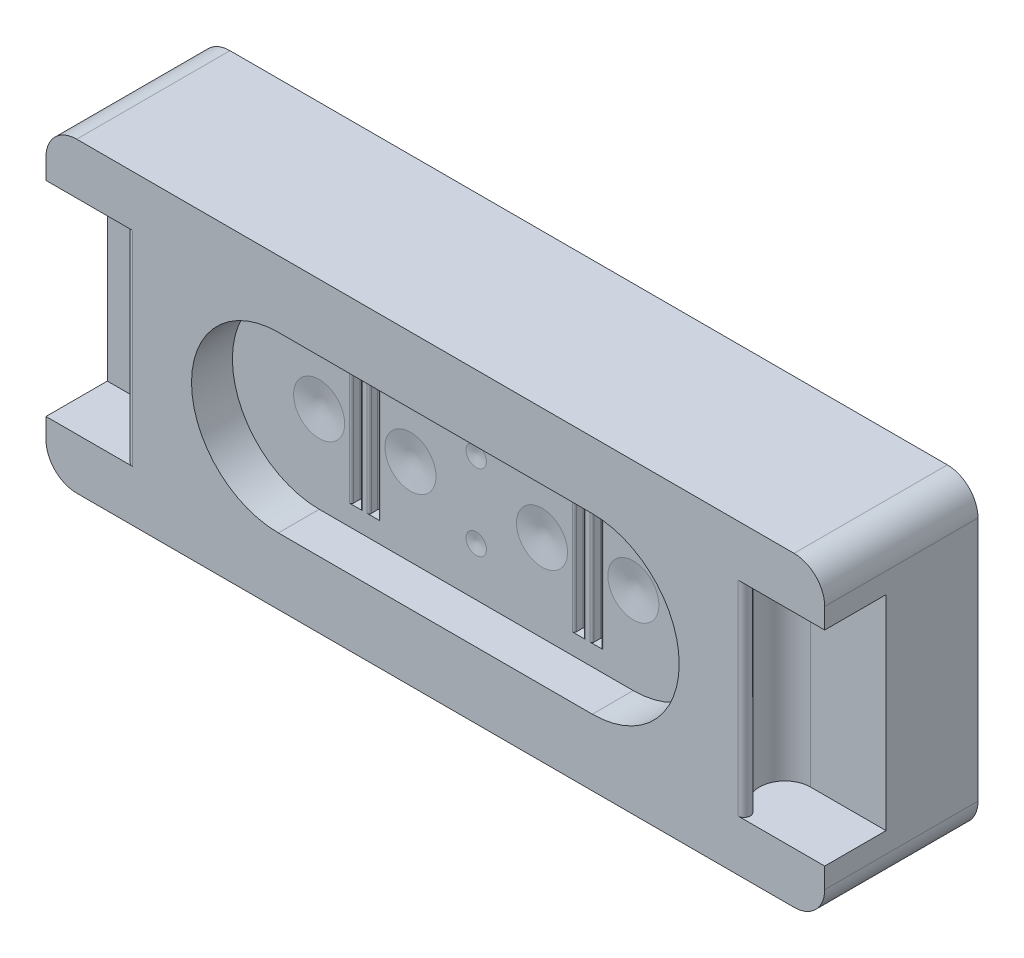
from build123d import *

# Parameters (mm, degrees)
SKETCH1_W             = 19.354999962
SKETCH1_H             = 7.62
BOSS_EXTRUDE1_DEPTH   = 3.81
CUT_EXTRUDE1_DEPTH    = 1.016
SKETCH3_R             = 0.635
SKETCH3_R_2           = 0.254
CUT_EXTRUDE2_DEPTH    = 11.769240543
CUT_EXTRUDE5_DEPTH    = 2.54
CUT_EXTRUDE6_DEPTH    = 5.08
FILLET1_R             = 0.762
SKETCH8_R             = 0.635
BOSS_EXTRUDE2_DEPTH   = 2.794
BOSS_EXTRUDE2_2_DEPTH = 2.794
SKETCH8_R_2           = 0.254
BOSS_EXTRUDE2_3_DEPTH = 2.794
BOSS_EXTRUDE2_4_DEPTH = 2.794
BOSS_EXTRUDE2_5_DEPTH = 2.794
BOSS_EXTRUDE2_6_DEPTH = 2.794
SKETCH13_W            = 0.22098
SKETCH13_H            = 3.302
CUT_EXTRUDE11_DEPTH   = 0.26
FILLET2_R             = 0.0508


with BuildPart() as part:
    # Sketch1 → Boss-Extrude1 (new body)
    with BuildSketch(Plane.XY):
        Rectangle(SKETCH1_W, SKETCH1_H)
    extrude(amount=BOSS_EXTRUDE1_DEPTH)

    # Sketch2 → Cut-Extrude1 (cut)
    with BuildSketch(Plane.XY.offset(3.81)):
        with BuildLine():
            Line((-3.901539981, 2.159), (3.901539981, 2.159))
            ThreePointArc((3.901539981, 2.159), (6.060539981, 0), (3.901539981, -2.159))
            Line((3.901539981, -2.159), (-3.901539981, -2.159))
            ThreePointArc((-3.901539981, -2.159), (-6.060539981, 0), (-3.901539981, 2.159))
        make_face()
    extrude(amount=-CUT_EXTRUDE1_DEPTH, mode=Mode.SUBTRACT)

    # Sketch3 → Cut-Extrude2 (cut, through all)
    with BuildSketch(Plane.XY.offset(2.794)):
        with Locations((-3.905, 0)):
            Circle(SKETCH3_R)
        with Locations((-1.635, 0)):
            Circle(SKETCH3_R)
        with Locations((1.635, 0)):
            Circle(SKETCH3_R)
        with Locations((3.905, 0)):
            Circle(SKETCH3_R)
        with Locations((0, 0.946095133)):
            Circle(SKETCH3_R_2)
        with Locations((0, -0.946095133)):
            Circle(SKETCH3_R_2)
    extrude(amount=-CUT_EXTRUDE2_DEPTH, mode=Mode.SUBTRACT)

    # Sketch6 → Cut-Extrude5 (cut, symmetric)
    with BuildSketch(Plane(origin=(0, 0, 0), x_dir=(1, 0, 0), z_dir=(0, 1, 0))):
        with BuildLine():
            Line((-7.8011, -3.556), (-7.8011, -3.81))
            Line((-7.8011, -3.81), (-9.677499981, -3.81))
            Line((-9.677499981, -3.81), (-9.677499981, -2.286))
            Line((-9.677499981, -2.286), (-7.8011, -2.286))
            ThreePointArc((-7.8011, -2.286), (-7.1661, -2.921), (-7.8011, -3.556))
        make_face()
        with BuildLine():
            Line((7.8011, -2.286), (9.677499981, -2.286))
            Line((9.677499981, -2.286), (9.677499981, -3.81))
            Line((9.677499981, -3.81), (7.8011, -3.81))
            Line((7.8011, -3.81), (7.8011, -3.556))
            ThreePointArc((7.8011, -3.556), (7.1661, -2.921), (7.8011, -2.286))
        make_face()
    extrude(amount=CUT_EXTRUDE5_DEPTH, both=True, mode=Mode.SUBTRACT)

    # Sketch7 → Cut-Extrude6 (cut)
    with BuildSketch(Plane.XZ.offset(-2.54)):
        with BuildLine():
            Line((-7.522856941, 3.81), (-7.8011, 3.81))
            Line((-7.8011, 3.81), (-7.8011, 3.556))
            ThreePointArc((-7.8011, 3.556), (-7.687050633, 3.545674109), (-7.576710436, 3.515032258))
            ThreePointArc((-7.576710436, 3.515032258), (-7.672778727, 3.684971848), (-7.522856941, 3.81))
        make_face()
        with BuildLine():
            Line((7.522856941, 3.81), (7.8011, 3.81))
            Line((7.8011, 3.81), (7.8011, 3.556))
            ThreePointArc((7.8011, 3.556), (7.687050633, 3.545674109), (7.576710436, 3.515032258))
            ThreePointArc((7.576710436, 3.515032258), (7.672778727, 3.684971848), (7.522856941, 3.81))
        make_face()
    extrude(amount=CUT_EXTRUDE6_DEPTH, mode=Mode.SUBTRACT)

    # Fillet1
    fillet1_edges = [part.edges().sort_by_distance(p)[0] for p in [
        (-9.677499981, 3.81, 1.905),
        (9.677499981, 3.81, 1.905),
        (9.677499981, -3.81, 1.905),
        (-9.677499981, -3.81, 1.905),
    ]]
    fillet(fillet1_edges, radius=FILLET1_R)

    # Sketch13 → Cut-Extrude11 (cut)
    with BuildSketch(Plane.XY.offset(2.794)):
        with Locations((-2.99098, 0)):
            Rectangle(SKETCH13_W, SKETCH13_H)
        with Locations((-2.54902, 0)):
            Rectangle(SKETCH13_W, SKETCH13_H)
        with Locations((2.54902, 0)):
            Rectangle(SKETCH13_W, SKETCH13_H)
        with Locations((2.99098, 0)):
            Rectangle(SKETCH13_W, SKETCH13_H)
    extrude(amount=-CUT_EXTRUDE11_DEPTH, mode=Mode.SUBTRACT)

    # Fillet2
    fillet2_edges = [part.edges().sort_by_distance(p)[0] for p in [
        (-3.10147, 0, 2.534),
        (-2.88049, 0, 2.534),
        (-3.10147, 0, 2.794),
        (-2.88049, 0, 2.794),
        (-2.65951, 0, 2.534),
        (-2.43853, 0, 2.534),
        (-2.65951, 0, 2.794),
        (-2.43853, 0, 2.794),
        (2.43853, 0, 2.534),
        (2.65951, 0, 2.534),
        (2.43853, 0, 2.794),
        (2.65951, 0, 2.794),
        (2.88049, 0, 2.534),
        (3.10147, 0, 2.534),
        (2.88049, 0, 2.794),
        (3.10147, 0, 2.794),
    ]]
    fillet(fillet2_edges, radius=FILLET2_R)


with BuildPart() as body_2:
    # Sketch8 → Boss-Extrude2 (new body)
    with BuildSketch(Plane.XY.offset(2.794)):
        with Locations((-3.905, 0)):
            Circle(SKETCH8_R)
    extrude(amount=-BOSS_EXTRUDE2_DEPTH)

    # Cut-Extrude7 cone 1 section (on through the dimple's axis) → Cut-Extrude7 (revolve, cut)
    with BuildSketch(Plane(origin=(-3.905, 0, 2.794), x_dir=(0, -1, 0), z_dir=(1, 0, 0))):
        Polygon((0, 0), (0.635, 0), (0, 0.111967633), align=None)
    revolve(axis=Axis((-3.905, 0, 2.794), (0, 0, -1)), mode=Mode.SUBTRACT)


with BuildPart() as body_3:
    # Sketch8 → Boss-Extrude2 2 (new body)
    with BuildSketch(Plane.XY.offset(2.794)):
        with Locations((-1.635, 0)):
            Circle(SKETCH8_R)
    extrude(amount=-BOSS_EXTRUDE2_2_DEPTH)

    # Cut-Extrude7 cone 2 section (on through the dimple's axis) → Cut-Extrude7 cone 2 (revolve, cut)
    with BuildSketch(Plane(origin=(-1.635, 0, 2.794), x_dir=(0, -1, 0), z_dir=(1, 0, 0))):
        Polygon((0, 0), (0.635, 0), (0, 0.111967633), align=None)
    revolve(axis=Axis((-1.635, 0, 2.794), (0, 0, -1)), mode=Mode.SUBTRACT)


with BuildPart() as body_4:
    # Sketch8 → Boss-Extrude2 3 (new body)
    with BuildSketch(Plane.XY.offset(2.794)):
        with Locations((0, -0.946095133)):
            Circle(SKETCH8_R_2)
    extrude(amount=-BOSS_EXTRUDE2_3_DEPTH)

    # Cut-Extrude8 cone 1 section (on through the dimple's axis) → Cut-Extrude8 (revolve, cut)
    with BuildSketch(Plane(origin=(0, -0.946095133, 2.794), x_dir=(0, -1, 0), z_dir=(1, 0, 0))):
        Polygon((0, 0), (0.254, 0), (0, 0.044787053), align=None)
    revolve(axis=Axis((0, -0.946095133, 2.794), (0, 0, -1)), mode=Mode.SUBTRACT)


with BuildPart() as body_5:
    # Sketch8 → Boss-Extrude2 4 (new body)
    with BuildSketch(Plane.XY.offset(2.794)):
        with Locations((1.635, 0)):
            Circle(SKETCH8_R)
    extrude(amount=-BOSS_EXTRUDE2_4_DEPTH)

    # Cut-Extrude7 cone 3 section (on through the dimple's axis) → Cut-Extrude7 cone 3 (revolve, cut)
    with BuildSketch(Plane(origin=(1.635, 0, 2.794), x_dir=(0, -1, 0), z_dir=(1, 0, 0))):
        Polygon((0, 0), (0.635, 0), (0, 0.111967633), align=None)
    revolve(axis=Axis((1.635, 0, 2.794), (0, 0, -1)), mode=Mode.SUBTRACT)


with BuildPart() as body_6:
    # Sketch8 → Boss-Extrude2 5 (new body)
    with BuildSketch(Plane.XY.offset(2.794)):
        with Locations((3.905, 0)):
            Circle(SKETCH8_R)
    extrude(amount=-BOSS_EXTRUDE2_5_DEPTH)

    # Cut-Extrude10 cone 1 section (on through the dimple's axis) → Cut-Extrude10 (revolve, cut)
    with BuildSketch(Plane(origin=(3.905, 0, 2.794), x_dir=(0, -1, 0), z_dir=(1, 0, 0))):
        Polygon((0, 0), (0.635, 0), (0, 0.111967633), align=None)
    revolve(axis=Axis((3.905, 0, 2.794), (0, 0, -1)), mode=Mode.SUBTRACT)


with BuildPart() as body_7:
    # Sketch8 → Boss-Extrude2 6 (new body)
    with BuildSketch(Plane.XY.offset(2.794)):
        with Locations((0, 0.946095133)):
            Circle(SKETCH8_R_2)
    extrude(amount=-BOSS_EXTRUDE2_6_DEPTH)

    # Cut-Extrude9 cone 1 section (on through the dimple's axis) → Cut-Extrude9 (revolve, cut)
    with BuildSketch(Plane(origin=(0, 0.946095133, 2.794), x_dir=(0, -1, 0), z_dir=(1, 0, 0))):
        Polygon((0, 0), (0.254, 0), (0, 0.044787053), align=None)
    revolve(axis=Axis((0, 0.946095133, 2.794), (0, 0, -1)), mode=Mode.SUBTRACT)


solid = Compound([part.part, body_2.part, body_3.part, body_4.part, body_5.part, body_6.part, body_7.part])
